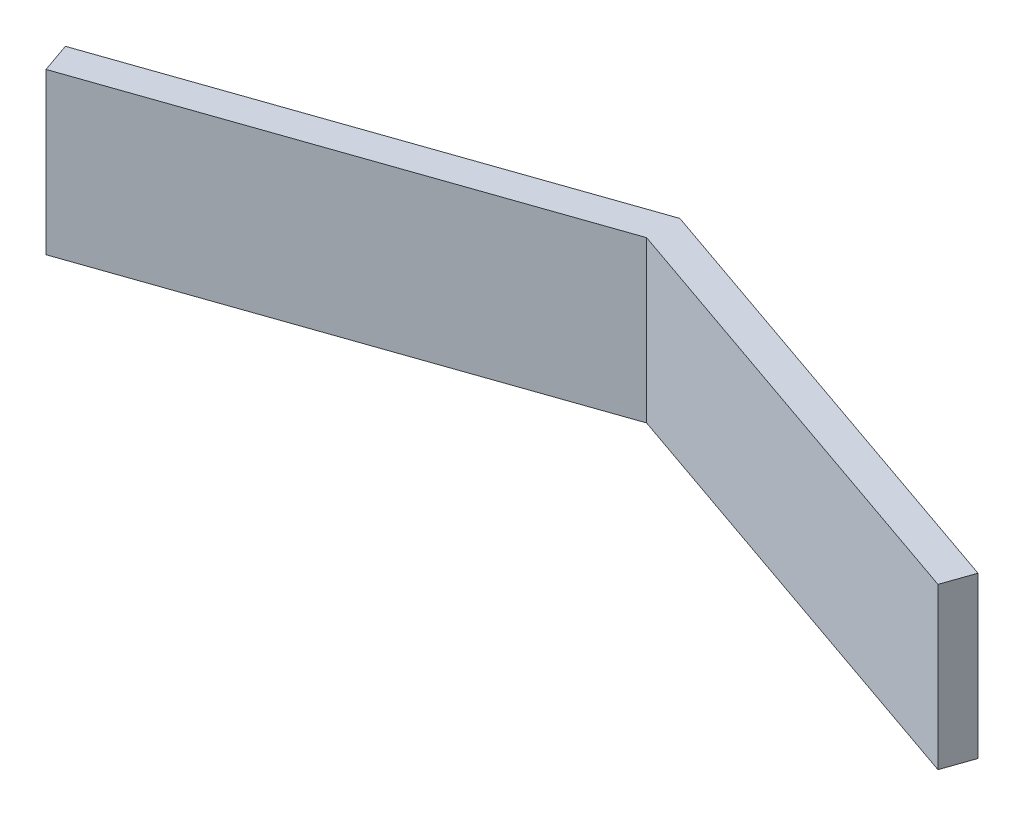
from build123d import *

# Parameters (mm, degrees)
SALIENTE_EXTRUIR1_DEPTH = 25.5


with BuildPart() as part:
    # Croquis2 → Saliente-Extruir1 (new, symmetric)
    with BuildSketch(Plane(origin=(0, 0, 0), x_dir=(1, 0, 0), z_dir=(0, 1, 0))):
        Polygon((-141.725429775, 0), (0, 49.131482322), (141.725429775, 0), (145.00086193, 9.448361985), (0, 59.715327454), (-145.00086193, 9.448361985), align=None)
    extrude(amount=SALIENTE_EXTRUIR1_DEPTH, both=True)


solid = part.part
